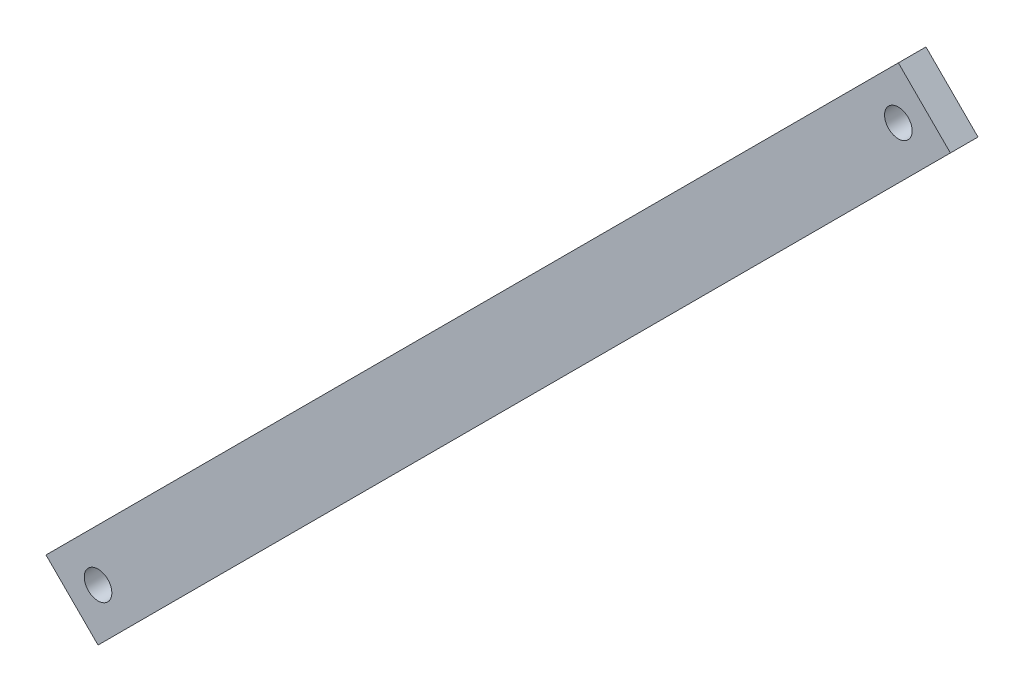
ISO-10303-21;
HEADER;
FILE_DESCRIPTION(('STEP AP214'),'2;1');
FILE_NAME('part.step','',(''),(''),'','','');
FILE_SCHEMA(('AUTOMOTIVE_DESIGN { 1 0 10303 214 1 1 1 1 }'));
ENDSEC;
DATA;
#1=APPLICATION_CONTEXT('core data for automotive mechanical design processes');
#2=APPLICATION_PROTOCOL_DEFINITION('international standard','automotive_design',2000,#1);
#3=PRODUCT_CONTEXT('',#1,'mechanical');
#4=PRODUCT('Part','Part','',(#3));
#5=PRODUCT_RELATED_PRODUCT_CATEGORY('part','',(#4));
#6=PRODUCT_DEFINITION_FORMATION('','',#4);
#7=PRODUCT_DEFINITION_CONTEXT('part definition',#1,'design');
#8=PRODUCT_DEFINITION('design','',#6,#7);
#9=PRODUCT_DEFINITION_SHAPE('','',#8);
#10=(LENGTH_UNIT() NAMED_UNIT(*) SI_UNIT(.MILLI.,.METRE.));
#11=(NAMED_UNIT(*) PLANE_ANGLE_UNIT() SI_UNIT($,.RADIAN.));
#12=(NAMED_UNIT(*) SI_UNIT($,.STERADIAN.) SOLID_ANGLE_UNIT());
#13=UNCERTAINTY_MEASURE_WITH_UNIT(LENGTH_MEASURE(1.E-05),#10,'distance_accuracy_value','');
#14=(GEOMETRIC_REPRESENTATION_CONTEXT(3) GLOBAL_UNCERTAINTY_ASSIGNED_CONTEXT((#13)) GLOBAL_UNIT_ASSIGNED_CONTEXT((#10,
#11,#12)) REPRESENTATION_CONTEXT('',''));
#15=CARTESIAN_POINT('',(0.,0.,0.));
#16=DIRECTION('',(0.,0.,1.));
#17=DIRECTION('',(1.,0.,0.));
#18=AXIS2_PLACEMENT_3D('',#15,#16,#17);
#19=CARTESIAN_POINT('',(92.6568542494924,87.,3.));
#20=DIRECTION('',(0.,0.,-1.));
#21=DIRECTION('',(-1.,0.,0.));
#22=AXIS2_PLACEMENT_3D('',#19,#20,#21);
#23=PLANE('',#22);
#24=CARTESIAN_POINT('',(87.,87.,3.));
#25=DIRECTION('',(0.,0.,1.));
#26=DIRECTION('',(1.,0.,0.));
#27=AXIS2_PLACEMENT_3D('',#24,#25,#26);
#28=CIRCLE('',#27,1.5);
#29=CARTESIAN_POINT('',(88.5,87.,3.));
#30=VERTEX_POINT('',#29);
#31=EDGE_CURVE('E90',#30,#30,#28,.T.);
#32=ORIENTED_EDGE('',*,*,#31,.F.);
#33=EDGE_LOOP('',(#32));
#34=FACE_BOUND('',#33,.T.);
#35=DIRECTION('',(-0.707106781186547,0.707106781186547,0.));
#36=VECTOR('',#35,1.);
#37=CARTESIAN_POINT('',(92.6568542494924,87.,3.));
#38=LINE('',#37,#36);
#39=CARTESIAN_POINT('',(92.6568542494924,87.,3.));
#40=VERTEX_POINT('',#39);
#41=CARTESIAN_POINT('',(87.,92.6568542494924,3.));
#42=VERTEX_POINT('',#41);
#43=EDGE_CURVE('E100',#40,#42,#38,.T.);
#44=ORIENTED_EDGE('',*,*,#43,.T.);
#45=DIRECTION('',(-0.707106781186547,-0.707106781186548,0.));
#46=VECTOR('',#45,1.);
#47=CARTESIAN_POINT('',(87.,92.6568542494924,3.));
#48=LINE('',#47,#46);
#49=CARTESIAN_POINT('',(-5.65685424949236,0.,3.));
#50=VERTEX_POINT('',#49);
#51=EDGE_CURVE('E85',#42,#50,#48,.T.);
#52=ORIENTED_EDGE('',*,*,#51,.T.);
#53=DIRECTION('',(0.707106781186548,-0.707106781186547,0.));
#54=VECTOR('',#53,1.);
#55=CARTESIAN_POINT('',(-5.65685424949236,0.,3.));
#56=LINE('',#55,#54);
#57=CARTESIAN_POINT('',(0.,-5.65685424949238,3.));
#58=VERTEX_POINT('',#57);
#59=EDGE_CURVE('E51',#50,#58,#56,.T.);
#60=ORIENTED_EDGE('',*,*,#59,.T.);
#61=DIRECTION('',(0.707106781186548,0.707106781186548,0.));
#62=VECTOR('',#61,1.);
#63=CARTESIAN_POINT('',(0.,-5.65685424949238,3.));
#64=LINE('',#63,#62);
#65=EDGE_CURVE('E46',#58,#40,#64,.T.);
#66=ORIENTED_EDGE('',*,*,#65,.T.);
#67=EDGE_LOOP('',(#44,#52,#60,#66));
#68=FACE_BOUND('',#67,.T.);
#69=CARTESIAN_POINT('',(0.,0.,3.));
#70=DIRECTION('',(0.,0.,1.));
#71=DIRECTION('',(1.,0.,0.));
#72=AXIS2_PLACEMENT_3D('',#69,#70,#71);
#73=CIRCLE('',#72,1.5);
#74=CARTESIAN_POINT('',(1.5,0.,3.));
#75=VERTEX_POINT('',#74);
#76=EDGE_CURVE('E118',#75,#75,#73,.T.);
#77=ORIENTED_EDGE('',*,*,#76,.F.);
#78=EDGE_LOOP('',(#77));
#79=FACE_BOUND('',#78,.T.);
#80=ADVANCED_FACE('F31',(#34,#68,#79),#23,.F.);
#81=CARTESIAN_POINT('',(92.6568542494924,87.,0.));
#82=DIRECTION('',(0.,0.,-1.));
#83=DIRECTION('',(-1.,0.,0.));
#84=AXIS2_PLACEMENT_3D('',#81,#82,#83);
#85=PLANE('',#84);
#86=CARTESIAN_POINT('',(87.,87.,0.));
#87=DIRECTION('',(0.,0.,1.));
#88=DIRECTION('',(1.,0.,0.));
#89=AXIS2_PLACEMENT_3D('',#86,#87,#88);
#90=CIRCLE('',#89,1.5);
#91=CARTESIAN_POINT('',(88.5,87.,0.));
#92=VERTEX_POINT('',#91);
#93=EDGE_CURVE('E93',#92,#92,#90,.T.);
#94=ORIENTED_EDGE('',*,*,#93,.T.);
#95=EDGE_LOOP('',(#94));
#96=FACE_BOUND('',#95,.T.);
#97=DIRECTION('',(-0.707106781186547,0.707106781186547,0.));
#98=VECTOR('',#97,1.);
#99=CARTESIAN_POINT('',(92.6568542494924,87.,0.));
#100=LINE('',#99,#98);
#101=CARTESIAN_POINT('',(92.6568542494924,87.,0.));
#102=VERTEX_POINT('',#101);
#103=CARTESIAN_POINT('',(87.,92.6568542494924,0.));
#104=VERTEX_POINT('',#103);
#105=EDGE_CURVE('E77',#102,#104,#100,.T.);
#106=ORIENTED_EDGE('',*,*,#105,.F.);
#107=DIRECTION('',(0.707106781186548,0.707106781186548,0.));
#108=VECTOR('',#107,1.);
#109=CARTESIAN_POINT('',(0.,-5.65685424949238,0.));
#110=LINE('',#109,#108);
#111=CARTESIAN_POINT('',(0.,-5.65685424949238,0.));
#112=VERTEX_POINT('',#111);
#113=EDGE_CURVE('E98',#112,#102,#110,.T.);
#114=ORIENTED_EDGE('',*,*,#113,.F.);
#115=DIRECTION('',(0.707106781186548,-0.707106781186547,0.));
#116=VECTOR('',#115,1.);
#117=CARTESIAN_POINT('',(-5.65685424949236,0.,0.));
#118=LINE('',#117,#116);
#119=CARTESIAN_POINT('',(-5.65685424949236,0.,0.));
#120=VERTEX_POINT('',#119);
#121=EDGE_CURVE('E78',#120,#112,#118,.T.);
#122=ORIENTED_EDGE('',*,*,#121,.F.);
#123=DIRECTION('',(-0.707106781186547,-0.707106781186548,0.));
#124=VECTOR('',#123,1.);
#125=CARTESIAN_POINT('',(87.,92.6568542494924,0.));
#126=LINE('',#125,#124);
#127=EDGE_CURVE('E72',#104,#120,#126,.T.);
#128=ORIENTED_EDGE('',*,*,#127,.F.);
#129=EDGE_LOOP('',(#106,#114,#122,#128));
#130=FACE_BOUND('',#129,.T.);
#131=CARTESIAN_POINT('',(0.,0.,0.));
#132=DIRECTION('',(0.,0.,1.));
#133=DIRECTION('',(1.,0.,0.));
#134=AXIS2_PLACEMENT_3D('',#131,#132,#133);
#135=CIRCLE('',#134,1.5);
#136=CARTESIAN_POINT('',(1.5,0.,0.));
#137=VERTEX_POINT('',#136);
#138=EDGE_CURVE('E120',#137,#137,#135,.T.);
#139=ORIENTED_EDGE('',*,*,#138,.T.);
#140=EDGE_LOOP('',(#139));
#141=FACE_BOUND('',#140,.T.);
#142=ADVANCED_FACE('F73',(#96,#130,#141),#85,.T.);
#143=CARTESIAN_POINT('',(92.6568542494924,87.,3.));
#144=DIRECTION('',(-0.707106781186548,-0.707106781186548,0.));
#145=DIRECTION('',(0.707106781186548,-0.707106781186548,0.));
#146=AXIS2_PLACEMENT_3D('',#143,#144,#145);
#147=PLANE('',#146);
#148=ORIENTED_EDGE('',*,*,#105,.T.);
#149=DIRECTION('',(0.,0.,-1.));
#150=VECTOR('',#149,1.);
#151=CARTESIAN_POINT('',(87.,92.6568542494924,3.));
#152=LINE('',#151,#150);
#153=EDGE_CURVE('E11',#42,#104,#152,.T.);
#154=ORIENTED_EDGE('',*,*,#153,.F.);
#155=ORIENTED_EDGE('',*,*,#43,.F.);
#156=DIRECTION('',(0.,0.,-1.));
#157=VECTOR('',#156,1.);
#158=CARTESIAN_POINT('',(92.6568542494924,87.,3.));
#159=LINE('',#158,#157);
#160=EDGE_CURVE('E89',#40,#102,#159,.T.);
#161=ORIENTED_EDGE('',*,*,#160,.T.);
#162=EDGE_LOOP('',(#148,#154,#155,#161));
#163=FACE_BOUND('',#162,.T.);
#164=ADVANCED_FACE('F33',(#163),#147,.F.);
#165=CARTESIAN_POINT('',(87.,92.6568542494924,3.));
#166=DIRECTION('',(0.707106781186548,-0.707106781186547,0.));
#167=DIRECTION('',(0.707106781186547,0.707106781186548,0.));
#168=AXIS2_PLACEMENT_3D('',#165,#166,#167);
#169=PLANE('',#168);
#170=ORIENTED_EDGE('',*,*,#127,.T.);
#171=DIRECTION('',(0.,0.,-1.));
#172=VECTOR('',#171,1.);
#173=CARTESIAN_POINT('',(-5.65685424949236,0.,3.));
#174=LINE('',#173,#172);
#175=EDGE_CURVE('E39',#50,#120,#174,.T.);
#176=ORIENTED_EDGE('',*,*,#175,.F.);
#177=ORIENTED_EDGE('',*,*,#51,.F.);
#178=ORIENTED_EDGE('',*,*,#153,.T.);
#179=EDGE_LOOP('',(#170,#176,#177,#178));
#180=FACE_BOUND('',#179,.T.);
#181=ADVANCED_FACE('F84',(#180),#169,.F.);
#182=CARTESIAN_POINT('',(-5.65685424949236,0.,3.));
#183=DIRECTION('',(0.707106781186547,0.707106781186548,0.));
#184=DIRECTION('',(-0.707106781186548,0.707106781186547,0.));
#185=AXIS2_PLACEMENT_3D('',#182,#183,#184);
#186=PLANE('',#185);
#187=ORIENTED_EDGE('',*,*,#121,.T.);
#188=DIRECTION('',(0.,0.,-1.));
#189=VECTOR('',#188,1.);
#190=CARTESIAN_POINT('',(0.,-5.65685424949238,3.));
#191=LINE('',#190,#189);
#192=EDGE_CURVE('E106',#58,#112,#191,.T.);
#193=ORIENTED_EDGE('',*,*,#192,.F.);
#194=ORIENTED_EDGE('',*,*,#59,.F.);
#195=ORIENTED_EDGE('',*,*,#175,.T.);
#196=EDGE_LOOP('',(#187,#193,#194,#195));
#197=FACE_BOUND('',#196,.T.);
#198=ADVANCED_FACE('F109',(#197),#186,.F.);
#199=CARTESIAN_POINT('',(0.,-5.65685424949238,3.));
#200=DIRECTION('',(-0.707106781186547,0.707106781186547,0.));
#201=DIRECTION('',(-0.707106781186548,-0.707106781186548,0.));
#202=AXIS2_PLACEMENT_3D('',#199,#200,#201);
#203=PLANE('',#202);
#204=ORIENTED_EDGE('',*,*,#113,.T.);
#205=ORIENTED_EDGE('',*,*,#160,.F.);
#206=ORIENTED_EDGE('',*,*,#65,.F.);
#207=ORIENTED_EDGE('',*,*,#192,.T.);
#208=EDGE_LOOP('',(#204,#205,#206,#207));
#209=FACE_BOUND('',#208,.T.);
#210=ADVANCED_FACE('F111',(#209),#203,.F.);
#211=CARTESIAN_POINT('',(87.,87.,3.));
#212=DIRECTION('',(0.,0.,-1.));
#213=DIRECTION('',(-1.,0.,0.));
#214=AXIS2_PLACEMENT_3D('',#211,#212,#213);
#215=CYLINDRICAL_SURFACE('',#214,1.5);
#216=ORIENTED_EDGE('',*,*,#31,.T.);
#217=EDGE_LOOP('',(#216));
#218=FACE_BOUND('',#217,.T.);
#219=ORIENTED_EDGE('',*,*,#93,.F.);
#220=EDGE_LOOP('',(#219));
#221=FACE_BOUND('',#220,.T.);
#222=ADVANCED_FACE('F129',(#218,#221),#215,.F.);
#223=CARTESIAN_POINT('',(0.,0.,3.));
#224=DIRECTION('',(0.,0.,-1.));
#225=DIRECTION('',(-1.,0.,0.));
#226=AXIS2_PLACEMENT_3D('',#223,#224,#225);
#227=CYLINDRICAL_SURFACE('',#226,1.5);
#228=ORIENTED_EDGE('',*,*,#76,.T.);
#229=EDGE_LOOP('',(#228));
#230=FACE_BOUND('',#229,.T.);
#231=ORIENTED_EDGE('',*,*,#138,.F.);
#232=EDGE_LOOP('',(#231));
#233=FACE_BOUND('',#232,.T.);
#234=ADVANCED_FACE('F127',(#230,#233),#227,.F.);
#235=CLOSED_SHELL('',(#80,#142,#164,#181,#198,#210,#222,#234));
#236=MANIFOLD_SOLID_BREP('B2',#235);
#237=ADVANCED_BREP_SHAPE_REPRESENTATION('',(#18,#236),#14);
#238=SHAPE_DEFINITION_REPRESENTATION(#9,#237);
ENDSEC;
END-ISO-10303-21;
